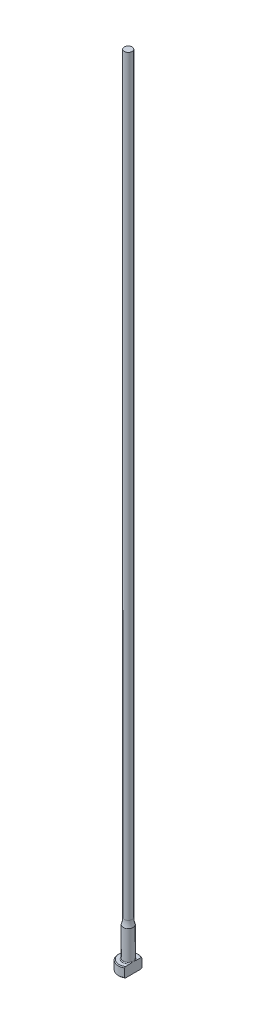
ISO-10303-21;
HEADER;
FILE_DESCRIPTION(('STEP AP214'),'2;1');
FILE_NAME('part.step','',(''),(''),'','','');
FILE_SCHEMA(('AUTOMOTIVE_DESIGN { 1 0 10303 214 1 1 1 1 }'));
ENDSEC;
DATA;
#1=APPLICATION_CONTEXT('core data for automotive mechanical design processes');
#2=APPLICATION_PROTOCOL_DEFINITION('international standard','automotive_design',2000,#1);
#3=PRODUCT_CONTEXT('',#1,'mechanical');
#4=PRODUCT('Part','Part','',(#3));
#5=PRODUCT_RELATED_PRODUCT_CATEGORY('part','',(#4));
#6=PRODUCT_DEFINITION_FORMATION('','',#4);
#7=PRODUCT_DEFINITION_CONTEXT('part definition',#1,'design');
#8=PRODUCT_DEFINITION('design','',#6,#7);
#9=PRODUCT_DEFINITION_SHAPE('','',#8);
#10=(LENGTH_UNIT() NAMED_UNIT(*) SI_UNIT(.MILLI.,.METRE.));
#11=(NAMED_UNIT(*) PLANE_ANGLE_UNIT() SI_UNIT($,.RADIAN.));
#12=(NAMED_UNIT(*) SI_UNIT($,.STERADIAN.) SOLID_ANGLE_UNIT());
#13=UNCERTAINTY_MEASURE_WITH_UNIT(LENGTH_MEASURE(1.E-05),#10,'distance_accuracy_value','');
#14=(GEOMETRIC_REPRESENTATION_CONTEXT(3) GLOBAL_UNCERTAINTY_ASSIGNED_CONTEXT((#13)) GLOBAL_UNIT_ASSIGNED_CONTEXT((#10,
#11,#12)) REPRESENTATION_CONTEXT('',''));
#15=CARTESIAN_POINT('',(0.,0.,0.));
#16=DIRECTION('',(0.,0.,1.));
#17=DIRECTION('',(1.,0.,0.));
#18=AXIS2_PLACEMENT_3D('',#15,#16,#17);
#19=CARTESIAN_POINT('',(-3.17499999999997,3.175,0.));
#20=DIRECTION('',(0.,1.,0.));
#21=DIRECTION('',(0.,0.,1.));
#22=AXIS2_PLACEMENT_3D('',#19,#20,#21);
#23=PLANE('',#22);
#24=CARTESIAN_POINT('',(0.,3.175,0.));
#25=DIRECTION('',(0.,1.,0.));
#26=DIRECTION('',(0.,0.,1.));
#27=AXIS2_PLACEMENT_3D('',#24,#25,#26);
#28=CIRCLE('',#27,2.92099999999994);
#29=CARTESIAN_POINT('',(1.58749999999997,3.175,-2.45195529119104));
#30=VERTEX_POINT('',#29);
#31=CARTESIAN_POINT('',(1.58749999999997,3.175,2.45195529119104));
#32=VERTEX_POINT('',#31);
#33=EDGE_CURVE('E105',#30,#32,#28,.T.);
#34=ORIENTED_EDGE('',*,*,#33,.T.);
#35=DIRECTION('',(0.,0.,1.));
#36=VECTOR('',#35,1.);
#37=CARTESIAN_POINT('',(1.58749999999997,3.17499999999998,2.74963065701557));
#38=LINE('',#37,#36);
#39=CARTESIAN_POINT('',(1.58749999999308,3.175,0.933255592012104));
#40=VERTEX_POINT('',#39);
#41=EDGE_CURVE('E126',#40,#32,#38,.T.);
#42=ORIENTED_EDGE('',*,*,#41,.F.);
#43=CARTESIAN_POINT('',(0.,3.175,0.));
#44=DIRECTION('',(0.,1.,0.));
#45=DIRECTION('',(0.,0.,1.));
#46=AXIS2_PLACEMENT_3D('',#43,#44,#45);
#47=CIRCLE('',#46,1.84149999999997);
#48=CARTESIAN_POINT('',(1.58749999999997,3.17500000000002,-0.933255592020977));
#49=VERTEX_POINT('',#48);
#50=EDGE_CURVE('E11',#40,#49,#47,.F.);
#51=ORIENTED_EDGE('',*,*,#50,.T.);
#52=EDGE_CURVE('E52',#30,#49,#38,.T.);
#53=ORIENTED_EDGE('',*,*,#52,.F.);
#54=EDGE_LOOP('',(#34,#42,#51,#53));
#55=FACE_BOUND('',#54,.T.);
#56=ADVANCED_FACE('F32',(#55),#23,.T.);
#57=CARTESIAN_POINT('',(0.,259.958771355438,0.));
#58=DIRECTION('',(0.,1.,0.));
#59=DIRECTION('',(0.,0.,1.));
#60=AXIS2_PLACEMENT_3D('',#57,#58,#59);
#61=CYLINDRICAL_SURFACE('',#60,3.17499999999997);
#62=CARTESIAN_POINT('',(0.,2.92100000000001,0.));
#63=DIRECTION('',(0.,1.,0.));
#64=DIRECTION('',(0.,0.,1.));
#65=AXIS2_PLACEMENT_3D('',#62,#63,#64);
#66=CIRCLE('',#65,3.17499999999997);
#67=CARTESIAN_POINT('',(1.58749999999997,2.92100000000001,2.74963065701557));
#68=VERTEX_POINT('',#67);
#69=CARTESIAN_POINT('',(1.58749999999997,2.92100000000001,-2.74963065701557));
#70=VERTEX_POINT('',#69);
#71=EDGE_CURVE('E98',#68,#70,#66,.F.);
#72=ORIENTED_EDGE('',*,*,#71,.T.);
#73=DIRECTION('',(0.,-1.,0.));
#74=VECTOR('',#73,1.);
#75=CARTESIAN_POINT('',(1.58749999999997,254.001,-2.74963065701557));
#76=LINE('',#75,#74);
#77=CARTESIAN_POINT('',(1.58749999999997,0.253999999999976,-2.74963065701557));
#78=VERTEX_POINT('',#77);
#79=EDGE_CURVE('E141',#70,#78,#76,.T.);
#80=ORIENTED_EDGE('',*,*,#79,.T.);
#81=CARTESIAN_POINT('',(0.,0.253999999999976,0.));
#82=DIRECTION('',(0.,-1.,0.));
#83=DIRECTION('',(0.,0.,-1.));
#84=AXIS2_PLACEMENT_3D('',#81,#82,#83);
#85=CIRCLE('',#84,3.17499999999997);
#86=CARTESIAN_POINT('',(1.58749999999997,0.253999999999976,2.74963065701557));
#87=VERTEX_POINT('',#86);
#88=EDGE_CURVE('E95',#78,#87,#85,.F.);
#89=ORIENTED_EDGE('',*,*,#88,.T.);
#90=DIRECTION('',(0.,-1.,0.));
#91=VECTOR('',#90,1.);
#92=CARTESIAN_POINT('',(1.58749999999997,254.001,2.74963065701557));
#93=LINE('',#92,#91);
#94=EDGE_CURVE('E88',#68,#87,#93,.T.);
#95=ORIENTED_EDGE('',*,*,#94,.F.);
#96=EDGE_LOOP('',(#72,#80,#89,#95));
#97=FACE_BOUND('',#96,.T.);
#98=ADVANCED_FACE('F191',(#97),#61,.T.);
#99=CARTESIAN_POINT('',(0.,0.,0.));
#100=DIRECTION('',(0.,-1.,0.));
#101=DIRECTION('',(0.,0.,-1.));
#102=AXIS2_PLACEMENT_3D('',#99,#100,#101);
#103=PLANE('',#102);
#104=CARTESIAN_POINT('',(0.,0.,0.));
#105=DIRECTION('',(0.,-1.,0.));
#106=DIRECTION('',(0.,0.,-1.));
#107=AXIS2_PLACEMENT_3D('',#104,#105,#106);
#108=CIRCLE('',#107,2.92100000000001);
#109=CARTESIAN_POINT('',(1.58749999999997,0.,2.45195529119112));
#110=VERTEX_POINT('',#109);
#111=CARTESIAN_POINT('',(1.58749999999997,0.,-2.45195529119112));
#112=VERTEX_POINT('',#111);
#113=EDGE_CURVE('E93',#110,#112,#108,.T.);
#114=ORIENTED_EDGE('',*,*,#113,.T.);
#115=DIRECTION('',(0.,0.,1.));
#116=VECTOR('',#115,1.);
#117=CARTESIAN_POINT('',(1.58749999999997,0.,2.74963065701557));
#118=LINE('',#117,#116);
#119=EDGE_CURVE('E78',#112,#110,#118,.T.);
#120=ORIENTED_EDGE('',*,*,#119,.T.);
#121=EDGE_LOOP('',(#114,#120));
#122=FACE_BOUND('',#121,.T.);
#123=ADVANCED_FACE('F97',(#122),#103,.T.);
#124=CARTESIAN_POINT('',(0.,3.17499999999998,0.));
#125=DIRECTION('',(0.,-1.,0.));
#126=DIRECTION('',(0.,0.,-1.));
#127=AXIS2_PLACEMENT_3D('',#124,#125,#126);
#128=CONICAL_SURFACE('',#127,2.92099999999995,0.785398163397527);
#129=ORIENTED_EDGE('',*,*,#71,.F.);
#130=CARTESIAN_POINT('',(1.58749999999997,-0.16162066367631,-6.0529050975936));
#131=CARTESIAN_POINT('',(1.58749999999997,-0.0288893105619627,-5.91567682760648));
#132=CARTESIAN_POINT('',(1.58749999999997,0.103699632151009,-5.7783103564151));
#133=CARTESIAN_POINT('',(1.58749999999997,0.368508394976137,-5.50321874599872));
#134=CARTESIAN_POINT('',(1.58749999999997,0.500728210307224,-5.36549360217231));
#135=CARTESIAN_POINT('',(1.58749999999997,0.764778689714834,-5.08953516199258));
#136=CARTESIAN_POINT('',(1.58749999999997,0.896609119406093,-4.9513016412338));
#137=CARTESIAN_POINT('',(1.58749999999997,1.15968706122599,-4.67428233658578));
#138=CARTESIAN_POINT('',(1.58749999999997,1.29093457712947,-4.53549655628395));
#139=CARTESIAN_POINT('',(1.58749999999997,1.55007705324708,-4.25997724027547));
#140=CARTESIAN_POINT('',(1.58749999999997,1.67798684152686,-4.12325766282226));
#141=CARTESIAN_POINT('',(1.58749999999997,1.9328486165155,-3.84892898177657));
#142=CARTESIAN_POINT('',(1.58749999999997,2.05980060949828,-3.71131988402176));
#143=CARTESIAN_POINT('',(1.58749999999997,2.31237508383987,-3.43493978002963));
#144=CARTESIAN_POINT('',(1.58749999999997,2.43799784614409,-3.29616903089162));
#145=CARTESIAN_POINT('',(1.58749999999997,2.68741369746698,-3.01699558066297));
#146=CARTESIAN_POINT('',(1.58749999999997,2.81120686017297,-2.8765929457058));
#147=CARTESIAN_POINT('',(1.58749999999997,3.00875865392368,-2.64816703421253));
#148=CARTESIAN_POINT('',(1.58749999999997,3.08336151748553,-2.56087478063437));
#149=CARTESIAN_POINT('',(1.58749999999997,3.2312387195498,-2.38515423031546));
#150=CARTESIAN_POINT('',(1.58749999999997,3.30451292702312,-2.29672582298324));
#151=CARTESIAN_POINT('',(1.58749999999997,3.45004422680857,-2.1174740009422));
#152=CARTESIAN_POINT('',(1.58749999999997,3.5222823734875,-2.02663514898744));
#153=CARTESIAN_POINT('',(1.58749999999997,3.66423097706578,-1.8430252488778));
#154=CARTESIAN_POINT('',(1.58749999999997,3.73394203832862,-1.75025467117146));
#155=CARTESIAN_POINT('',(1.58749999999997,3.87080633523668,-1.5606747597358));
#156=CARTESIAN_POINT('',(1.58749999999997,3.93790459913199,-1.46382547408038));
#157=CARTESIAN_POINT('',(1.58749999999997,4.06669147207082,-1.26632594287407));
#158=CARTESIAN_POINT('',(1.58749999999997,4.1283726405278,-1.16567073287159));
#159=CARTESIAN_POINT('',(1.58749999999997,4.21402252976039,-1.01165766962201));
#160=CARTESIAN_POINT('',(1.58749999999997,4.24127929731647,-0.960142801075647));
#161=CARTESIAN_POINT('',(1.58749999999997,4.2930979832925,-0.855780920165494));
#162=CARTESIAN_POINT('',(1.58749999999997,4.31765941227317,-0.802933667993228));
#163=CARTESIAN_POINT('',(1.58749999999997,4.38614656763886,-0.642461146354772));
#164=CARTESIAN_POINT('',(1.58749999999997,4.42510149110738,-0.532518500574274));
#165=CARTESIAN_POINT('',(1.58749999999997,4.46726244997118,-0.367680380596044));
#166=CARTESIAN_POINT('',(1.58749999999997,4.47844427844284,-0.314802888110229));
#167=CARTESIAN_POINT('',(1.58749999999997,4.49576654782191,-0.208209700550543));
#168=CARTESIAN_POINT('',(1.58749999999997,4.50190743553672,-0.154494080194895));
#169=CARTESIAN_POINT('',(1.58749999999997,4.50871296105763,-0.0468792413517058));
#170=CARTESIAN_POINT('',(1.58749999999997,4.5093945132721,0.00701889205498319));
#171=CARTESIAN_POINT('',(1.58749999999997,4.50527679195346,0.114606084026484));
#172=CARTESIAN_POINT('',(1.58749999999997,4.50047706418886,0.168295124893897));
#173=CARTESIAN_POINT('',(1.58749999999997,4.48579689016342,0.27448544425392));
#174=CARTESIAN_POINT('',(1.58749999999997,4.47596081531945,0.32699298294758));
#175=CARTESIAN_POINT('',(1.58749999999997,4.45181809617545,0.430974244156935));
#176=CARTESIAN_POINT('',(1.58749999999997,4.4375096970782,0.482447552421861));
#177=CARTESIAN_POINT('',(1.58749999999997,4.40502489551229,0.584460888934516));
#178=CARTESIAN_POINT('',(1.58749999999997,4.386827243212,0.634994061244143));
#179=CARTESIAN_POINT('',(1.58749999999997,4.34729308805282,0.734789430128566));
#180=CARTESIAN_POINT('',(1.58749999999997,4.3259572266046,0.784051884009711));
#181=CARTESIAN_POINT('',(1.58749999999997,4.25791922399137,0.930549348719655));
#182=CARTESIAN_POINT('',(1.58749999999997,4.20736047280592,1.0259880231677));
#183=CARTESIAN_POINT('',(1.58749999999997,4.0995545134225,1.21304313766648));
#184=CARTESIAN_POINT('',(1.58749999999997,4.04229912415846,1.30465471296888));
#185=CARTESIAN_POINT('',(1.58749999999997,3.92308746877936,1.48526211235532));
#186=CARTESIAN_POINT('',(1.58749999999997,3.86111349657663,1.57424615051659));
#187=CARTESIAN_POINT('',(1.58749999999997,3.73408621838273,1.74990003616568));
#188=CARTESIAN_POINT('',(1.58749999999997,3.66903444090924,1.83657099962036));
#189=CARTESIAN_POINT('',(1.58749999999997,3.53583371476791,2.00931764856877));
#190=CARTESIAN_POINT('',(1.58749999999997,3.46765527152,2.09537048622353));
#191=CARTESIAN_POINT('',(1.58749999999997,3.32960643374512,2.26611736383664));
#192=CARTESIAN_POINT('',(1.58749999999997,3.25973586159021,2.35081125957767));
#193=CARTESIAN_POINT('',(1.58749999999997,3.04858139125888,2.60290121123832));
#194=CARTESIAN_POINT('',(1.58749999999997,2.90542388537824,2.76872537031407));
#195=CARTESIAN_POINT('',(1.58749999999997,2.64069522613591,3.06970913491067));
#196=CARTESIAN_POINT('',(1.58749999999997,2.51959458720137,3.20528660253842));
#197=CARTESIAN_POINT('',(1.58749999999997,2.27590400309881,3.47510321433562));
#198=CARTESIAN_POINT('',(1.58749999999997,2.15331401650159,3.60934232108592));
#199=CARTESIAN_POINT('',(1.58749999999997,1.90694239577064,3.87695374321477));
#200=CARTESIAN_POINT('',(1.58749999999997,1.78315974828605,4.0103251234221));
#201=CARTESIAN_POINT('',(1.58749999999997,1.53478104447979,4.27630880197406));
#202=CARTESIAN_POINT('',(1.58749999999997,1.41018498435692,4.40892109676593));
#203=CARTESIAN_POINT('',(1.58749999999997,1.0457468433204,4.79499418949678));
#204=CARTESIAN_POINT('',(1.58749999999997,0.80507680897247,5.04767313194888));
#205=CARTESIAN_POINT('',(1.58749999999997,0.443121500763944,5.42550911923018));
#206=CARTESIAN_POINT('',(1.58749999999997,0.322378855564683,5.55118772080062));
#207=CARTESIAN_POINT('',(1.58749999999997,0.0805914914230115,5.80225207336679));
#208=CARTESIAN_POINT('',(1.58749999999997,-0.040453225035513,5.92763782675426));
#209=CARTESIAN_POINT('',(1.58749999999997,-0.161620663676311,6.0529050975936));
#210=B_SPLINE_CURVE_WITH_KNOTS('',3,(#130,#131,#132,#133,#134,#135,#136,#137,#138,#139,#140,
#141,#142,#143,#144,#145,#146,#147,#148,#149,#150,#151,#152,#153,#154,#155,#156,#157,#158,#159,
#160,#161,#162,#163,#164,#165,#166,#167,#168,#169,#170,#171,#172,#173,#174,#175,#176,#177,#178,
#179,#180,#181,#182,#183,#184,#185,#186,#187,#188,#189,#190,#191,#192,#193,#194,#195,#196,#197,
#198,#199,#200,#201,#202,#203,#204,#205,#206,#207,#208,#209),.UNSPECIFIED.,.F.,.F.,(4,2,2,2,2,2,
2,2,2,2,2,2,2,2,2,2,2,2,2,2,2,2,2,2,2,2,2,2,2,2,2,2,2,2,2,2,2,2,2,4),(0.,0.572750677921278,
1.14550874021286,1.71856057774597,2.29160869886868,2.85328006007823,3.4149477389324,
3.97649423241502,4.53801804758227,4.88249307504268,5.22700189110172,5.5751532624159,
5.92322081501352,6.27657800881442,6.63041319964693,6.80518126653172,6.9799810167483,
7.3282426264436,7.49018491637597,7.65211285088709,7.81353889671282,7.97497832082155,
8.13501929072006,8.29512313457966,8.45612518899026,8.61709438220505,8.94062993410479,
9.2645649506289,9.58978187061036,9.91483894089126,10.2441741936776,10.5735441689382,
11.2306812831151,11.7760337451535,12.3214014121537,12.8672825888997,13.4131663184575,
14.4600164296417,14.9828595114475,15.5056983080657),.UNSPECIFIED.);
#211=EDGE_CURVE('E118',#32,#68,#210,.T.);
#212=ORIENTED_EDGE('',*,*,#211,.F.);
#213=ORIENTED_EDGE('',*,*,#33,.F.);
#214=EDGE_CURVE('E117',#70,#30,#210,.T.);
#215=ORIENTED_EDGE('',*,*,#214,.F.);
#216=EDGE_LOOP('',(#129,#212,#213,#215));
#217=FACE_BOUND('',#216,.T.);
#218=ADVANCED_FACE('F162',(#217),#128,.T.);
#219=CARTESIAN_POINT('',(0.,0.253999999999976,0.));
#220=DIRECTION('',(0.,1.,0.));
#221=DIRECTION('',(0.,0.,1.));
#222=AXIS2_PLACEMENT_3D('',#219,#220,#221);
#223=CONICAL_SURFACE('',#222,3.17499999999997,0.785398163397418);
#224=ORIENTED_EDGE('',*,*,#88,.F.);
#225=CARTESIAN_POINT('',(1.58749999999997,3.33662066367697,6.0529050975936));
#226=CARTESIAN_POINT('',(1.58749999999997,3.20388931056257,5.91567682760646));
#227=CARTESIAN_POINT('',(1.58749999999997,3.07130036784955,5.77831035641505));
#228=CARTESIAN_POINT('',(1.58749999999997,2.80649160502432,5.50321874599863));
#229=CARTESIAN_POINT('',(1.58749999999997,2.67427178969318,5.3654936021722));
#230=CARTESIAN_POINT('',(1.58749999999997,2.41022131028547,5.08953516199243));
#231=CARTESIAN_POINT('',(1.58749999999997,2.27839088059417,4.95130164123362));
#232=CARTESIAN_POINT('',(1.58749999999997,2.01531293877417,4.67428233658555));
#233=CARTESIAN_POINT('',(1.58749999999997,1.88406542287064,4.5354965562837));
#234=CARTESIAN_POINT('',(1.58749999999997,1.62492294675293,4.25997724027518));
#235=CARTESIAN_POINT('',(1.58749999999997,1.49701315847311,4.12325766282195));
#236=CARTESIAN_POINT('',(1.58749999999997,1.24215138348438,3.84892898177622));
#237=CARTESIAN_POINT('',(1.58749999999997,1.11519939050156,3.71131988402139));
#238=CARTESIAN_POINT('',(1.58749999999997,0.862624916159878,3.43493978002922));
#239=CARTESIAN_POINT('',(1.58749999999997,0.737002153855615,3.29616903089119));
#240=CARTESIAN_POINT('',(1.58749999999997,0.487586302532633,3.01699558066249));
#241=CARTESIAN_POINT('',(1.58749999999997,0.363793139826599,2.8765929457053));
#242=CARTESIAN_POINT('',(1.58749999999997,0.166241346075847,2.64816703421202));
#243=CARTESIAN_POINT('',(1.58749999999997,0.0916384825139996,2.56087478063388));
#244=CARTESIAN_POINT('',(1.58749999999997,-0.0562387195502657,2.385154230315));
#245=CARTESIAN_POINT('',(1.58749999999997,-0.129512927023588,2.29672582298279));
#246=CARTESIAN_POINT('',(1.58749999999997,-0.27504422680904,2.11747400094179));
#247=CARTESIAN_POINT('',(1.58749999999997,-0.347282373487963,2.02663514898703));
#248=CARTESIAN_POINT('',(1.58749999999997,-0.489230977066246,1.84302524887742));
#249=CARTESIAN_POINT('',(1.58749999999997,-0.558942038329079,1.7502546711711));
#250=CARTESIAN_POINT('',(1.58749999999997,-0.695806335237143,1.56067475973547));
#251=CARTESIAN_POINT('',(1.58749999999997,-0.762904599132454,1.46382547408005));
#252=CARTESIAN_POINT('',(1.58749999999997,-0.891691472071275,1.26632594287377));
#253=CARTESIAN_POINT('',(1.58749999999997,-0.953372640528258,1.16567073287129));
#254=CARTESIAN_POINT('',(1.58749999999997,-1.03902252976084,1.01165766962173));
#255=CARTESIAN_POINT('',(1.58749999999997,-1.06627929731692,0.960142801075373));
#256=CARTESIAN_POINT('',(1.58749999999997,-1.11809798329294,0.85578092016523));
#257=CARTESIAN_POINT('',(1.58749999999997,-1.14265941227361,0.802933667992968));
#258=CARTESIAN_POINT('',(1.58749999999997,-1.21114656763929,0.642461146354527));
#259=CARTESIAN_POINT('',(1.58749999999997,-1.2501014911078,0.532518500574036));
#260=CARTESIAN_POINT('',(1.58749999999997,-1.29226244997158,0.367680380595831));
#261=CARTESIAN_POINT('',(1.58749999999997,-1.30344427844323,0.314802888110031));
#262=CARTESIAN_POINT('',(1.58749999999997,-1.32076654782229,0.208209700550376));
#263=CARTESIAN_POINT('',(1.58749999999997,-1.3269074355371,0.154494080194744));
#264=CARTESIAN_POINT('',(1.58749999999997,-1.333712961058,0.0468792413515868));
#265=CARTESIAN_POINT('',(1.58749999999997,-1.33439451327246,-0.00701889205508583));
#266=CARTESIAN_POINT('',(1.58749999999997,-1.33027679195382,-0.114606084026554));
#267=CARTESIAN_POINT('',(1.58749999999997,-1.32547706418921,-0.168295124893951));
#268=CARTESIAN_POINT('',(1.58749999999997,-1.31079689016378,-0.274485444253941));
#269=CARTESIAN_POINT('',(1.58749999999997,-1.3009608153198,-0.326992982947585));
#270=CARTESIAN_POINT('',(1.58749999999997,-1.27681809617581,-0.430974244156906));
#271=CARTESIAN_POINT('',(1.58749999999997,-1.26250969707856,-0.482447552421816));
#272=CARTESIAN_POINT('',(1.58749999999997,-1.23002489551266,-0.584460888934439));
#273=CARTESIAN_POINT('',(1.58749999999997,-1.21182724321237,-0.634994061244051));
#274=CARTESIAN_POINT('',(1.58749999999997,-1.1722930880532,-0.734789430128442));
#275=CARTESIAN_POINT('',(1.58749999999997,-1.15095722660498,-0.784051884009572));
#276=CARTESIAN_POINT('',(1.58749999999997,-1.08291922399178,-0.93054934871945));
#277=CARTESIAN_POINT('',(1.58749999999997,-1.03236047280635,-1.02598802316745));
#278=CARTESIAN_POINT('',(1.58749999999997,-0.924554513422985,-1.21304313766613));
#279=CARTESIAN_POINT('',(1.58749999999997,-0.86729912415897,-1.30465471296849));
#280=CARTESIAN_POINT('',(1.58749999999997,-0.748087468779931,-1.48526211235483));
#281=CARTESIAN_POINT('',(1.58749999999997,-0.686113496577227,-1.57424615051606));
#282=CARTESIAN_POINT('',(1.58749999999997,-0.55908621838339,-1.74990003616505));
#283=CARTESIAN_POINT('',(1.58749999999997,-0.494034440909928,-1.83657099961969));
#284=CARTESIAN_POINT('',(1.58749999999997,-0.360833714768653,-2.00931764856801));
#285=CARTESIAN_POINT('',(1.58749999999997,-0.292655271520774,-2.09537048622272));
#286=CARTESIAN_POINT('',(1.58749999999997,-0.154606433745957,-2.26611736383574));
#287=CARTESIAN_POINT('',(1.58749999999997,-0.0847358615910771,-2.35081125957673));
#288=CARTESIAN_POINT('',(1.58749999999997,0.126418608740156,-2.60290121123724));
#289=CARTESIAN_POINT('',(1.58749999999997,0.269576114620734,-2.76872537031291));
#290=CARTESIAN_POINT('',(1.58749999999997,0.534304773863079,-3.06970913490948));
#291=CARTESIAN_POINT('',(1.58749999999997,0.655405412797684,-3.20528660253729));
#292=CARTESIAN_POINT('',(1.58749999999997,0.899095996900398,-3.47510321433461));
#293=CARTESIAN_POINT('',(1.58749999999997,1.02168598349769,-3.60934232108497));
#294=CARTESIAN_POINT('',(1.58749999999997,1.26805760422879,-3.87695374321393));
#295=CARTESIAN_POINT('',(1.58749999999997,1.39184025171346,-4.01032512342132));
#296=CARTESIAN_POINT('',(1.58749999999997,1.64021895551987,-4.2763088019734));
#297=CARTESIAN_POINT('',(1.58749999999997,1.76481501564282,-4.40892109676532));
#298=CARTESIAN_POINT('',(1.58749999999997,2.12925315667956,-4.79499418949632));
#299=CARTESIAN_POINT('',(1.58749999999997,2.36992319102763,-5.04767313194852));
#300=CARTESIAN_POINT('',(1.58749999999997,2.73187849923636,-5.42550911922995));
#301=CARTESIAN_POINT('',(1.58749999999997,2.85262114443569,-5.55118772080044));
#302=CARTESIAN_POINT('',(1.58749999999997,3.09440850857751,-5.8022520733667));
#303=CARTESIAN_POINT('',(1.58749999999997,3.2154532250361,-5.92763782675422));
#304=CARTESIAN_POINT('',(1.58749999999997,3.33662066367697,-6.0529050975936));
#305=B_SPLINE_CURVE_WITH_KNOTS('',3,(#225,#226,#227,#228,#229,#230,#231,#232,#233,#234,#235,
#236,#237,#238,#239,#240,#241,#242,#243,#244,#245,#246,#247,#248,#249,#250,#251,#252,#253,#254,
#255,#256,#257,#258,#259,#260,#261,#262,#263,#264,#265,#266,#267,#268,#269,#270,#271,#272,#273,
#274,#275,#276,#277,#278,#279,#280,#281,#282,#283,#284,#285,#286,#287,#288,#289,#290,#291,#292,
#293,#294,#295,#296,#297,#298,#299,#300,#301,#302,#303,#304),.UNSPECIFIED.,.F.,.F.,(4,2,2,2,2,2,
2,2,2,2,2,2,2,2,2,2,2,2,2,2,2,2,2,2,2,2,2,2,2,2,2,2,2,2,2,2,2,2,2,4),(0.,0.57275067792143,
1.14550874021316,1.71856057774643,2.29160869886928,2.85328006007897,3.41494773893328,
3.97649423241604,4.53801804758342,4.88249307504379,5.2270018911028,5.57515326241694,
5.92322081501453,6.27657800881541,6.63041319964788,6.80518126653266,6.97998101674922,
7.32824262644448,7.49018491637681,7.65211285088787,7.81353889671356,7.97497832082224,
8.1350192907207,8.29512313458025,8.45612518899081,8.61709438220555,8.94062993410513,
9.26456495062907,9.58978187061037,9.91483894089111,10.2441741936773,10.5735441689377,
11.2306812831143,11.776033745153,12.3214014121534,12.8672825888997,13.4131663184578,
14.4600164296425,14.9828595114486,15.505698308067),.UNSPECIFIED.);
#306=EDGE_CURVE('E81',#112,#78,#305,.T.);
#307=ORIENTED_EDGE('',*,*,#306,.F.);
#308=ORIENTED_EDGE('',*,*,#113,.F.);
#309=EDGE_CURVE('E84',#87,#110,#305,.T.);
#310=ORIENTED_EDGE('',*,*,#309,.F.);
#311=EDGE_LOOP('',(#224,#307,#308,#310));
#312=FACE_BOUND('',#311,.T.);
#313=ADVANCED_FACE('F92',(#312),#223,.T.);
#314=CARTESIAN_POINT('',(0.,3.42900000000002,0.));
#315=DIRECTION('',(0.,1.,0.));
#316=DIRECTION('',(0.,0.,1.));
#317=AXIS2_PLACEMENT_3D('',#314,#315,#316);
#318=TOROIDAL_SURFACE('',#317,1.84149999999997,0.254);
#319=CARTESIAN_POINT('',(1.58749999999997,3.42900000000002,0.));
#320=CARTESIAN_POINT('',(1.58749999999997,3.42899942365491,-1.9220514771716E-10));
#321=CARTESIAN_POINT('',(1.58749999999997,3.42899884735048,-1.2261161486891E-07));
#322=CARTESIAN_POINT('',(1.58749999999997,3.42899773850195,-5.09676365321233E-07));
#323=CARTESIAN_POINT('',(1.58749999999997,3.42899720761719,-7.78176328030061E-07));
#324=CARTESIAN_POINT('',(1.58749999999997,3.42899614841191,-1.42307272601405E-06));
#325=CARTESIAN_POINT('',(1.58749999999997,3.42899562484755,-1.80713867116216E-06));
#326=CARTESIAN_POINT('',(1.58749999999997,3.42899463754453,-2.63494846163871E-06));
#327=CARTESIAN_POINT('',(1.58749999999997,3.42899417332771,-3.07814756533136E-06));
#328=CARTESIAN_POINT('',(1.58749999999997,3.42899261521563,-4.66897357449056E-06));
#329=CARTESIAN_POINT('',(1.58749999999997,3.42899159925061,-5.89404908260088E-06));
#330=CARTESIAN_POINT('',(1.58749999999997,3.42898979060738,-8.42427511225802E-06));
#331=CARTESIAN_POINT('',(1.58749999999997,3.42898899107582,-9.7248057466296E-06));
#332=CARTESIAN_POINT('',(1.58749999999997,3.42898598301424,-1.48060601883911E-05));
#333=CARTESIAN_POINT('',(1.58749999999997,3.42898393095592,-1.86838281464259E-05));
#334=CARTESIAN_POINT('',(1.58749999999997,3.42898057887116,-2.63261117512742E-05));
#335=CARTESIAN_POINT('',(1.58749999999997,3.42897922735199,-3.00687417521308E-05));
#336=CARTESIAN_POINT('',(1.58749999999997,3.42897347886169,-4.60276298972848E-05));
#337=CARTESIAN_POINT('',(1.58749999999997,3.42896911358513,-5.8247019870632E-05));
#338=CARTESIAN_POINT('',(1.58749999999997,3.42896211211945,-8.11070097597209E-05));
#339=CARTESIAN_POINT('',(1.58749999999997,3.42895931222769,-9.16953114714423E-05));
#340=CARTESIAN_POINT('',(1.58749999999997,3.42893712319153,-0.000168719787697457));
#341=CARTESIAN_POINT('',(1.58749999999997,3.42890881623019,-0.000232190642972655));
#342=CARTESIAN_POINT('',(1.58749999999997,3.42880276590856,-0.000479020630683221));
#343=CARTESIAN_POINT('',(1.58749999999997,3.42873165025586,-0.00066443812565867));
#344=CARTESIAN_POINT('',(1.58749999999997,3.42845137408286,-0.0013844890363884));
#345=CARTESIAN_POINT('',(1.58749999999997,3.42823526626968,-0.00191701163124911));
#346=CARTESIAN_POINT('',(1.58749999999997,3.42735449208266,-0.00409774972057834));
#347=CARTESIAN_POINT('',(1.58749999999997,3.42669768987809,-0.00574830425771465));
#348=CARTESIAN_POINT('',(1.58749999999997,3.4174405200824,-0.0289985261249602));
#349=CARTESIAN_POINT('',(1.58749999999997,3.40878325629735,-0.0505816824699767));
#350=CARTESIAN_POINT('',(1.58749999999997,3.39189297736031,-0.0929947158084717));
#351=CARTESIAN_POINT('',(1.58749999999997,3.38365605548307,-0.11382315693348));
#352=CARTESIAN_POINT('',(1.58749999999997,3.36635393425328,-0.157956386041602));
#353=CARTESIAN_POINT('',(1.58749999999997,3.35730391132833,-0.181267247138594));
#354=CARTESIAN_POINT('',(1.58749999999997,3.33936775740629,-0.228222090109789));
#355=CARTESIAN_POINT('',(1.58749999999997,3.33048420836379,-0.25186705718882));
#356=CARTESIAN_POINT('',(1.58749999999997,3.30894496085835,-0.310512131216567));
#357=CARTESIAN_POINT('',(1.58749999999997,3.29649449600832,-0.345588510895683));
#358=CARTESIAN_POINT('',(1.58749999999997,3.27296975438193,-0.415278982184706));
#359=CARTESIAN_POINT('',(1.58749999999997,3.26186987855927,-0.449884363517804));
#360=CARTESIAN_POINT('',(1.58749999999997,3.2395832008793,-0.524471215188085));
#361=CARTESIAN_POINT('',(1.58749999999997,3.22860862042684,-0.564517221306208));
#362=CARTESIAN_POINT('',(1.58749999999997,3.20902534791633,-0.645529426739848));
#363=CARTESIAN_POINT('',(1.58749999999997,3.20043582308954,-0.686500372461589));
#364=CARTESIAN_POINT('',(1.58749999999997,3.18611712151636,-0.771546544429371));
#365=CARTESIAN_POINT('',(1.58749999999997,3.18059550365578,-0.815658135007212));
#366=CARTESIAN_POINT('',(1.58749999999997,3.17455396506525,-0.904117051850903));
#367=CARTESIAN_POINT('',(1.58749999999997,3.17401361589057,-0.948462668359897));
#368=CARTESIAN_POINT('',(1.58749999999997,3.17898948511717,-1.02531896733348));
#369=CARTESIAN_POINT('',(1.58749999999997,3.1829739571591,-1.05792141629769));
#370=CARTESIAN_POINT('',(1.58749999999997,3.19569167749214,-1.12184393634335));
#371=CARTESIAN_POINT('',(1.58749999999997,3.20436049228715,-1.1531753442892));
#372=CARTESIAN_POINT('',(1.58749999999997,3.22236152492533,-1.19946468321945));
#373=CARTESIAN_POINT('',(1.58749999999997,3.2295150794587,-1.21526783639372));
#374=CARTESIAN_POINT('',(1.58749999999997,3.24587062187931,-1.24583726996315));
#375=CARTESIAN_POINT('',(1.58749999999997,3.25507530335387,-1.26060215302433));
#376=CARTESIAN_POINT('',(1.58749999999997,3.27378481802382,-1.28575815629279));
#377=CARTESIAN_POINT('',(1.58749999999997,3.28289001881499,-1.29644383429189));
#378=CARTESIAN_POINT('',(1.58749999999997,3.30268460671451,-1.31623154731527));
#379=CARTESIAN_POINT('',(1.58749999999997,3.31337067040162,-1.32533681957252));
#380=CARTESIAN_POINT('',(1.58749999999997,3.33349977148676,-1.33941140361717));
#381=CARTESIAN_POINT('',(1.58749999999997,3.34261446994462,-1.34484814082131));
#382=CARTESIAN_POINT('',(1.58749999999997,3.36161455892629,-1.35416329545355));
#383=CARTESIAN_POINT('',(1.58749999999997,3.37149946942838,-1.35804267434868));
#384=CARTESIAN_POINT('',(1.58749999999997,3.39188678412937,-1.36398436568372));
#385=CARTESIAN_POINT('',(1.58749999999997,3.40239309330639,-1.36603350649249));
#386=CARTESIAN_POINT('',(1.58749999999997,3.42360372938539,-1.3680840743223));
#387=CARTESIAN_POINT('',(1.58749999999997,3.43430795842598,-1.36808648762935));
#388=CARTESIAN_POINT('',(1.58749999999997,3.45433283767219,-1.36616208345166));
#389=CARTESIAN_POINT('',(1.58749999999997,3.46367506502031,-1.36444960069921));
#390=CARTESIAN_POINT('',(1.58749999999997,3.48195519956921,-1.35953338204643));
#391=CARTESIAN_POINT('',(1.58749999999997,3.49089304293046,-1.3563294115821));
#392=CARTESIAN_POINT('',(1.58749999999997,3.50850302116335,-1.34848006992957));
#393=CARTESIAN_POINT('',(1.58749999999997,3.5171531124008,-1.34378578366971));
#394=CARTESIAN_POINT('',(1.58749999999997,3.53371257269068,-1.33324445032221));
#395=CARTESIAN_POINT('',(1.58749999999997,3.54162163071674,-1.32739692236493));
#396=CARTESIAN_POINT('',(1.58749999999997,3.56107121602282,-1.31107304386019));
#397=CARTESIAN_POINT('',(1.58749999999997,3.57202221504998,-1.29989286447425));
#398=CARTESIAN_POINT('',(1.58749999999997,3.59202509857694,-1.27593566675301));
#399=CARTESIAN_POINT('',(1.58749999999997,3.60107086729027,-1.26315370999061));
#400=CARTESIAN_POINT('',(1.58749999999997,3.62186023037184,-1.22930733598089));
#401=CARTESIAN_POINT('',(1.58749999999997,3.63240584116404,-1.20751096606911));
#402=CARTESIAN_POINT('',(1.58749999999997,3.65004643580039,-1.16266144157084));
#403=CARTESIAN_POINT('',(1.58749999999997,3.65714435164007,-1.13960937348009));
#404=CARTESIAN_POINT('',(1.58749999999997,3.67265428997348,-1.07603916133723));
#405=CARTESIAN_POINT('',(1.58749999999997,3.67834921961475,-1.03486686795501));
#406=CARTESIAN_POINT('',(1.58749999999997,3.68382880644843,-0.951558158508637));
#407=CARTESIAN_POINT('',(1.58749999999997,3.68350976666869,-0.909417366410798));
#408=CARTESIAN_POINT('',(1.58749999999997,3.67745397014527,-0.811383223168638));
#409=CARTESIAN_POINT('',(1.58749999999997,3.66993873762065,-0.755610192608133));
#410=CARTESIAN_POINT('',(1.58749999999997,3.64933373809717,-0.644937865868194));
#411=CARTESIAN_POINT('',(1.58749999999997,3.63621897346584,-0.59004364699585));
#412=CARTESIAN_POINT('',(1.58749999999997,3.60740922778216,-0.485757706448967));
#413=CARTESIAN_POINT('',(1.58749999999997,3.59201096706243,-0.436281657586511));
#414=CARTESIAN_POINT('',(1.58749999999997,3.55922497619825,-0.338551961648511));
#415=CARTESIAN_POINT('',(1.58749999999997,3.5418584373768,-0.290291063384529));
#416=CARTESIAN_POINT('',(1.58749999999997,3.51760237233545,-0.225557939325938));
#417=CARTESIAN_POINT('',(1.58749999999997,3.51126413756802,-0.208874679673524));
#418=CARTESIAN_POINT('',(1.58749999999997,3.49830042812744,-0.17512392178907));
#419=CARTESIAN_POINT('',(1.58749999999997,3.49167176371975,-0.158057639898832));
#420=CARTESIAN_POINT('',(1.58749999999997,3.47585523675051,-0.117638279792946));
#421=CARTESIAN_POINT('',(1.58749999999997,3.46662970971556,-0.0943002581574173));
#422=CARTESIAN_POINT('',(1.58749999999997,3.44889695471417,-0.0497824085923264));
#423=CARTESIAN_POINT('',(1.58749999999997,3.44040039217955,-0.028598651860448));
#424=CARTESIAN_POINT('',(1.58749999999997,3.43130364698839,-0.00575168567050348));
#425=CARTESIAN_POINT('',(1.58749999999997,3.43064818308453,-0.00410451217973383));
#426=CARTESIAN_POINT('',(1.58749999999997,3.42976776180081,-0.00192459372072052));
#427=CARTESIAN_POINT('',(1.58749999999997,3.42955062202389,-0.00138952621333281));
#428=CARTESIAN_POINT('',(1.58749999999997,3.42926908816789,-0.000666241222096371));
#429=CARTESIAN_POINT('',(1.58749999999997,3.42919771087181,-0.000480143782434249));
#430=CARTESIAN_POINT('',(1.58749999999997,3.42909131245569,-0.000232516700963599));
#431=CARTESIAN_POINT('',(1.58749999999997,3.42906294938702,-0.000168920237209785));
#432=CARTESIAN_POINT('',(1.58749999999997,3.42904072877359,-9.17527162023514E-05));
#433=CARTESIAN_POINT('',(1.58749999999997,3.42903792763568,-8.11550293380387E-05));
#434=CARTESIAN_POINT('',(1.58749999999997,3.42903091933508,-5.82743948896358E-05));
#435=CARTESIAN_POINT('',(1.58749999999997,3.42902654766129,-4.60440001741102E-05));
#436=CARTESIAN_POINT('',(1.58749999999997,3.42902079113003,-3.00727682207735E-05));
#437=CARTESIAN_POINT('',(1.58749999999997,3.42901943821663,-2.63286807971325E-05));
#438=CARTESIAN_POINT('',(1.58749999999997,3.42901608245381,-1.86836529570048E-05));
#439=CARTESIAN_POINT('',(1.58749999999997,3.4290140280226,-1.48046517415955E-05));
#440=CARTESIAN_POINT('',(1.58749999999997,3.42901101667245,-9.72223943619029E-06));
#441=CARTESIAN_POINT('',(1.58749999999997,3.42901021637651,-8.42159649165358E-06));
#442=CARTESIAN_POINT('',(1.58749999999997,3.42900840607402,-5.89129729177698E-06));
#443=CARTESIAN_POINT('',(1.58749999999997,3.42900738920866,-4.66626867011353E-06));
#444=CARTESIAN_POINT('',(1.58749999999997,3.42900582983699,-3.07568803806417E-06));
#445=CARTESIAN_POINT('',(1.58749999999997,3.42900536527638,-2.63259565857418E-06));
#446=CARTESIAN_POINT('',(1.58749999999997,3.4290043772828,-1.80506085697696E-06));
#447=CARTESIAN_POINT('',(1.58749999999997,3.42900385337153,-1.42116387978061E-06));
#448=CARTESIAN_POINT('',(1.58749999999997,3.42900279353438,-7.76675643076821E-07));
#449=CARTESIAN_POINT('',(1.58749999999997,3.42900226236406,-5.08406487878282E-07));
#450=CARTESIAN_POINT('',(1.58749999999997,3.42900115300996,-1.21901887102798E-07));
#451=CARTESIAN_POINT('',(1.58749999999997,3.42900057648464,1.92251677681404E-10));
#452=CARTESIAN_POINT('',(1.58749999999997,3.42900000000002,0.));
#453=B_SPLINE_CURVE_WITH_KNOTS('',3,(#319,#320,#321,#322,#323,#324,#325,#326,#327,#328,#329,
#330,#331,#332,#333,#334,#335,#336,#337,#338,#339,#340,#341,#342,#343,#344,#345,#346,#347,#348,
#349,#350,#351,#352,#353,#354,#355,#356,#357,#358,#359,#360,#361,#362,#363,#364,#365,#366,#367,
#368,#369,#370,#371,#372,#373,#374,#375,#376,#377,#378,#379,#380,#381,#382,#383,#384,#385,#386,
#387,#388,#389,#390,#391,#392,#393,#394,#395,#396,#397,#398,#399,#400,#401,#402,#403,#404,#405,
#406,#407,#408,#409,#410,#411,#412,#413,#414,#415,#416,#417,#418,#419,#420,#421,#422,#423,#424,
#425,#426,#427,#428,#429,#430,#431,#432,#433,#434,#435,#436,#437,#438,#439,#440,#441,#442,#443,
#444,#445,#446,#447,#448,#449,#450,#451,#452),.UNSPECIFIED.,.T.,.F.,(4,2,2,2,2,2,2,2,2,2,2,2,2,
2,2,2,2,2,2,2,2,2,2,2,2,2,2,2,2,2,2,2,2,2,2,2,2,2,2,2,2,2,2,2,2,2,2,2,2,2,2,2,2,2,2,2,2,2,2,2,2,
2,2,2,2,2,4),(0.,1.72815458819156E-06,3.50429255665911E-06,5.44431004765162E-06,
7.3675525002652E-06,1.2119089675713E-05,1.66953775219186E-05,2.98160400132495E-05,
4.17409564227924E-05,8.0660475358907E-05,0.000113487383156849,0.000321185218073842,
0.000917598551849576,0.00264089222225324,0.00797105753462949,0.0777276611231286,
0.144923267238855,0.219939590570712,0.295714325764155,0.407362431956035,0.516367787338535,
0.640878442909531,0.766362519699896,0.899536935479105,1.03216495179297,1.13045740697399,
1.22743103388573,1.27935899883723,1.33135556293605,1.37333248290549,1.41522237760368,
1.44693946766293,1.47863694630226,1.51056074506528,1.54246916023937,1.57083210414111,
1.59919951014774,1.62861579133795,1.65804436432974,1.70472658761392,1.75155645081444,
1.82378709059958,1.89595619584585,2.01995471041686,2.1460932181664,2.31447224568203,
2.48361094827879,2.6389891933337,2.79283011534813,2.84637031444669,2.9012946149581,
2.97658236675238,3.04504771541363,3.05036697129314,3.05209849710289,3.05269709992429,
3.05290520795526,3.05293806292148,3.05297701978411,3.05298895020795,3.05300207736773,
3.05300665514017,3.0530114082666,3.05301333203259,3.05301527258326,3.05301704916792,
3.05301877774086),.UNSPECIFIED.);
#454=CARTESIAN_POINT('',(1.58749999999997,3.42900000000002,0.));
#455=VERTEX_POINT('',#454);
#456=EDGE_CURVE('E47',#455,#49,#453,.T.);
#457=ORIENTED_EDGE('',*,*,#456,.T.);
#458=ORIENTED_EDGE('',*,*,#50,.F.);
#459=CARTESIAN_POINT('',(1.58749999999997,3.42900000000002,0.));
#460=CARTESIAN_POINT('',(1.58749999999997,3.42900057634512,1.9220512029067E-10));
#461=CARTESIAN_POINT('',(1.58749999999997,3.42900115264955,1.22611614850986E-07));
#462=CARTESIAN_POINT('',(1.58749999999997,3.42900226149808,5.09676365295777E-07));
#463=CARTESIAN_POINT('',(1.58749999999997,3.42900279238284,7.78176328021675E-07));
#464=CARTESIAN_POINT('',(1.58749999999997,3.42900385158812,1.42307272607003E-06));
#465=CARTESIAN_POINT('',(1.58749999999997,3.42900437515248,1.80713867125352E-06));
#466=CARTESIAN_POINT('',(1.58749999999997,3.4290053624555,2.63494846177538E-06));
#467=CARTESIAN_POINT('',(1.58749999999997,3.42900582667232,3.0781475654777E-06));
#468=CARTESIAN_POINT('',(1.58749999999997,3.4290073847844,4.66897357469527E-06));
#469=CARTESIAN_POINT('',(1.58749999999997,3.42900840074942,5.89404908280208E-06));
#470=CARTESIAN_POINT('',(1.58749999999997,3.42901020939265,8.42427511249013E-06));
#471=CARTESIAN_POINT('',(1.58749999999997,3.42901100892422,9.72480574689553E-06));
#472=CARTESIAN_POINT('',(1.58749999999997,3.42901401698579,1.48060601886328E-05));
#473=CARTESIAN_POINT('',(1.58749999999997,3.42901606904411,1.86838281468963E-05));
#474=CARTESIAN_POINT('',(1.58749999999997,3.42901942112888,2.63261117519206E-05));
#475=CARTESIAN_POINT('',(1.58749999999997,3.42902077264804,3.00687417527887E-05));
#476=CARTESIAN_POINT('',(1.58749999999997,3.42902652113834,4.60276298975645E-05));
#477=CARTESIAN_POINT('',(1.58749999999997,3.4290308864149,5.82470198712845E-05));
#478=CARTESIAN_POINT('',(1.58749999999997,3.42903788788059,8.11070097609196E-05));
#479=CARTESIAN_POINT('',(1.58749999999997,3.42904068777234,9.16953114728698E-05));
#480=CARTESIAN_POINT('',(1.58749999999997,3.4290628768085,0.000168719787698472));
#481=CARTESIAN_POINT('',(1.58749999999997,3.42909118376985,0.000232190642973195));
#482=CARTESIAN_POINT('',(1.58749999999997,3.42919723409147,0.000479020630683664));
#483=CARTESIAN_POINT('',(1.58749999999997,3.42926834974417,0.000664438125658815));
#484=CARTESIAN_POINT('',(1.58749999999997,3.42954862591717,0.00138448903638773));
#485=CARTESIAN_POINT('',(1.58749999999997,3.42976473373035,0.00191701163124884));
#486=CARTESIAN_POINT('',(1.58749999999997,3.43064550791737,0.00409774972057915));
#487=CARTESIAN_POINT('',(1.58749999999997,3.43130231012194,0.00574830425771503));
#488=CARTESIAN_POINT('',(1.58749999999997,3.44055947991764,0.0289985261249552));
#489=CARTESIAN_POINT('',(1.58749999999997,3.44921674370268,0.0505816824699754));
#490=CARTESIAN_POINT('',(1.58749999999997,3.46610702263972,0.0929947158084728));
#491=CARTESIAN_POINT('',(1.58749999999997,3.47434394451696,0.11382315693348));
#492=CARTESIAN_POINT('',(1.58749999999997,3.49164606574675,0.157956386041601));
#493=CARTESIAN_POINT('',(1.58749999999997,3.5006960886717,0.181267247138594));
#494=CARTESIAN_POINT('',(1.58749999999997,3.51863224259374,0.228222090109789));
#495=CARTESIAN_POINT('',(1.58749999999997,3.52751579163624,0.25186705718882));
#496=CARTESIAN_POINT('',(1.58749999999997,3.54905503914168,0.310512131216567));
#497=CARTESIAN_POINT('',(1.58749999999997,3.56150550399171,0.345588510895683));
#498=CARTESIAN_POINT('',(1.58749999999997,3.5850302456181,0.415278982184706));
#499=CARTESIAN_POINT('',(1.58749999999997,3.59613012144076,0.449884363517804));
#500=CARTESIAN_POINT('',(1.58749999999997,3.61841679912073,0.524471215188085));
#501=CARTESIAN_POINT('',(1.58749999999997,3.62939137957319,0.564517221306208));
#502=CARTESIAN_POINT('',(1.58749999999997,3.6489746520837,0.645529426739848));
#503=CARTESIAN_POINT('',(1.58749999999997,3.65756417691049,0.686500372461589));
#504=CARTESIAN_POINT('',(1.58749999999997,3.67188287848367,0.771546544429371));
#505=CARTESIAN_POINT('',(1.58749999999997,3.67740449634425,0.815658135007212));
#506=CARTESIAN_POINT('',(1.58749999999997,3.68344603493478,0.904117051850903));
#507=CARTESIAN_POINT('',(1.58749999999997,3.68398638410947,0.948462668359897));
#508=CARTESIAN_POINT('',(1.58749999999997,3.67901051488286,1.02531896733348));
#509=CARTESIAN_POINT('',(1.58749999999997,3.67502604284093,1.05792141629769));
#510=CARTESIAN_POINT('',(1.58749999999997,3.66230832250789,1.12184393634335));
#511=CARTESIAN_POINT('',(1.58749999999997,3.65363950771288,1.1531753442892));
#512=CARTESIAN_POINT('',(1.58749999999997,3.6356384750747,1.19946468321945));
#513=CARTESIAN_POINT('',(1.58749999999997,3.62848492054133,1.21526783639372));
#514=CARTESIAN_POINT('',(1.58749999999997,3.61212937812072,1.24583726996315));
#515=CARTESIAN_POINT('',(1.58749999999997,3.60292469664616,1.26060215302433));
#516=CARTESIAN_POINT('',(1.58749999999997,3.58421518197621,1.28575815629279));
#517=CARTESIAN_POINT('',(1.58749999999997,3.57510998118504,1.29644383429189));
#518=CARTESIAN_POINT('',(1.58749999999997,3.55531539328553,1.31623154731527));
#519=CARTESIAN_POINT('',(1.58749999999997,3.54462932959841,1.32533681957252));
#520=CARTESIAN_POINT('',(1.58749999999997,3.52450022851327,1.33941140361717));
#521=CARTESIAN_POINT('',(1.58749999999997,3.51538553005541,1.34484814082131));
#522=CARTESIAN_POINT('',(1.58749999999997,3.49638544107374,1.35416329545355));
#523=CARTESIAN_POINT('',(1.58749999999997,3.48650053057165,1.35804267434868));
#524=CARTESIAN_POINT('',(1.58749999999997,3.46611321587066,1.36398436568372));
#525=CARTESIAN_POINT('',(1.58749999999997,3.45560690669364,1.36603350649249));
#526=CARTESIAN_POINT('',(1.58749999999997,3.43439627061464,1.3680840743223));
#527=CARTESIAN_POINT('',(1.58749999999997,3.42369204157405,1.36808648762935));
#528=CARTESIAN_POINT('',(1.58749999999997,3.40366716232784,1.36616208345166));
#529=CARTESIAN_POINT('',(1.58749999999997,3.39432493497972,1.36444960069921));
#530=CARTESIAN_POINT('',(1.58749999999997,3.37604480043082,1.35953338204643));
#531=CARTESIAN_POINT('',(1.58749999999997,3.36710695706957,1.3563294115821));
#532=CARTESIAN_POINT('',(1.58749999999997,3.34949697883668,1.34848006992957));
#533=CARTESIAN_POINT('',(1.58749999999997,3.34084688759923,1.34378578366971));
#534=CARTESIAN_POINT('',(1.58749999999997,3.32428742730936,1.33324445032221));
#535=CARTESIAN_POINT('',(1.58749999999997,3.31637836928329,1.32739692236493));
#536=CARTESIAN_POINT('',(1.58749999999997,3.29692878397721,1.31107304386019));
#537=CARTESIAN_POINT('',(1.58749999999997,3.28597778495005,1.29989286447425));
#538=CARTESIAN_POINT('',(1.58749999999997,3.26597490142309,1.27593566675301));
#539=CARTESIAN_POINT('',(1.58749999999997,3.25692913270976,1.26315370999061));
#540=CARTESIAN_POINT('',(1.58749999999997,3.23613976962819,1.22930733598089));
#541=CARTESIAN_POINT('',(1.58749999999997,3.22559415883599,1.20751096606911));
#542=CARTESIAN_POINT('',(1.58749999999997,3.20795356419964,1.16266144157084));
#543=CARTESIAN_POINT('',(1.58749999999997,3.20085564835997,1.13960937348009));
#544=CARTESIAN_POINT('',(1.58749999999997,3.18534571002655,1.07603916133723));
#545=CARTESIAN_POINT('',(1.58749999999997,3.17965078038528,1.03486686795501));
#546=CARTESIAN_POINT('',(1.58749999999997,3.1741711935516,0.951558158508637));
#547=CARTESIAN_POINT('',(1.58749999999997,3.17449023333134,0.909417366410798));
#548=CARTESIAN_POINT('',(1.58749999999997,3.18054602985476,0.811383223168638));
#549=CARTESIAN_POINT('',(1.58749999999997,3.18806126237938,0.755610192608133));
#550=CARTESIAN_POINT('',(1.58749999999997,3.20866626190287,0.644937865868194));
#551=CARTESIAN_POINT('',(1.58749999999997,3.2217810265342,0.59004364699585));
#552=CARTESIAN_POINT('',(1.58749999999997,3.25059077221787,0.485757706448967));
#553=CARTESIAN_POINT('',(1.58749999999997,3.2659890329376,0.43628165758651));
#554=CARTESIAN_POINT('',(1.58749999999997,3.29877502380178,0.338551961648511));
#555=CARTESIAN_POINT('',(1.58749999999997,3.31614156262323,0.290291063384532));
#556=CARTESIAN_POINT('',(1.58749999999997,3.34039762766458,0.225557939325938));
#557=CARTESIAN_POINT('',(1.58749999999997,3.346735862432,0.208874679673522));
#558=CARTESIAN_POINT('',(1.58749999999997,3.35969957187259,0.175123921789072));
#559=CARTESIAN_POINT('',(1.58749999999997,3.3663282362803,0.15805763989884));
#560=CARTESIAN_POINT('',(1.58749999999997,3.3821447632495,0.117638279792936));
#561=CARTESIAN_POINT('',(1.58749999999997,3.39137029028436,0.0943002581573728));
#562=CARTESIAN_POINT('',(1.58749999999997,3.40910304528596,0.0497824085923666));
#563=CARTESIAN_POINT('',(1.58749999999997,3.41759960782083,0.0285986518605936));
#564=CARTESIAN_POINT('',(1.58749999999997,3.42669635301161,0.00575168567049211));
#565=CARTESIAN_POINT('',(1.58749999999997,3.42735181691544,0.00410451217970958));
#566=CARTESIAN_POINT('',(1.58749999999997,3.42823223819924,0.00192459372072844));
#567=CARTESIAN_POINT('',(1.58749999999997,3.42844937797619,0.00138952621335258));
#568=CARTESIAN_POINT('',(1.58749999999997,3.42873091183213,0.000666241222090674));
#569=CARTESIAN_POINT('',(1.58749999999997,3.42880228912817,0.000480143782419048));
#570=CARTESIAN_POINT('',(1.58749999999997,3.42890868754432,0.000232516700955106));
#571=CARTESIAN_POINT('',(1.58749999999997,3.42893705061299,0.000168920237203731));
#572=CARTESIAN_POINT('',(1.58749999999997,3.42895927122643,9.17527161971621E-05));
#573=CARTESIAN_POINT('',(1.58749999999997,3.42896207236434,8.1155029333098E-05));
#574=CARTESIAN_POINT('',(1.58749999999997,3.42896908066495,5.82743948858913E-05));
#575=CARTESIAN_POINT('',(1.58749999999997,3.42897345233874,4.60440001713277E-05));
#576=CARTESIAN_POINT('',(1.58749999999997,3.42897920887,3.00727682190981E-05));
#577=CARTESIAN_POINT('',(1.58749999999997,3.42898056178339,2.63286807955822E-05));
#578=CARTESIAN_POINT('',(1.58749999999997,3.42898391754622,1.86836529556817E-05));
#579=CARTESIAN_POINT('',(1.58749999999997,3.42898597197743,1.48046517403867E-05));
#580=CARTESIAN_POINT('',(1.58749999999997,3.42898898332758,9.72223943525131E-06));
#581=CARTESIAN_POINT('',(1.58749999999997,3.42898978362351,8.42159649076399E-06));
#582=CARTESIAN_POINT('',(1.58749999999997,3.42899159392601,5.89129729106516E-06));
#583=CARTESIAN_POINT('',(1.58749999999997,3.42899261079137,4.66626866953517E-06));
#584=CARTESIAN_POINT('',(1.58749999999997,3.42899417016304,3.0756880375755E-06));
#585=CARTESIAN_POINT('',(1.58749999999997,3.42899463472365,2.63259565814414E-06));
#586=CARTESIAN_POINT('',(1.58749999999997,3.42899562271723,1.80506085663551E-06));
#587=CARTESIAN_POINT('',(1.58749999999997,3.42899614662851,1.42116387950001E-06));
#588=CARTESIAN_POINT('',(1.58749999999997,3.42899720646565,7.7667564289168E-07));
#589=CARTESIAN_POINT('',(1.58749999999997,3.42899773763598,5.0840648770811E-07));
#590=CARTESIAN_POINT('',(1.58749999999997,3.42899884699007,1.21901887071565E-07));
#591=CARTESIAN_POINT('',(1.58749999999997,3.42899942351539,-1.92251650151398E-10));
#592=CARTESIAN_POINT('',(1.58749999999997,3.42900000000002,0.));
#593=B_SPLINE_CURVE_WITH_KNOTS('',3,(#459,#460,#461,#462,#463,#464,#465,#466,#467,#468,#469,
#470,#471,#472,#473,#474,#475,#476,#477,#478,#479,#480,#481,#482,#483,#484,#485,#486,#487,#488,
#489,#490,#491,#492,#493,#494,#495,#496,#497,#498,#499,#500,#501,#502,#503,#504,#505,#506,#507,
#508,#509,#510,#511,#512,#513,#514,#515,#516,#517,#518,#519,#520,#521,#522,#523,#524,#525,#526,
#527,#528,#529,#530,#531,#532,#533,#534,#535,#536,#537,#538,#539,#540,#541,#542,#543,#544,#545,
#546,#547,#548,#549,#550,#551,#552,#553,#554,#555,#556,#557,#558,#559,#560,#561,#562,#563,#564,
#565,#566,#567,#568,#569,#570,#571,#572,#573,#574,#575,#576,#577,#578,#579,#580,#581,#582,#583,
#584,#585,#586,#587,#588,#589,#590,#591,#592),.UNSPECIFIED.,.T.,.F.,(4,2,2,2,2,2,2,2,2,2,2,2,2,
2,2,2,2,2,2,2,2,2,2,2,2,2,2,2,2,2,2,2,2,2,2,2,2,2,2,2,2,2,2,2,2,2,2,2,2,2,2,2,2,2,2,2,2,2,2,2,2,
2,2,2,2,2,4),(0.,1.72815458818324E-06,3.50429255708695E-06,5.44431004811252E-06,
7.36755250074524E-06,1.21190896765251E-05,1.66953775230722E-05,2.98160400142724E-05,
4.17409564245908E-05,8.06604753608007E-05,0.000113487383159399,0.000321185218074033,
0.000917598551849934,0.00264089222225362,0.00797105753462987,0.077727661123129,
0.144923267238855,0.219939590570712,0.295714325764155,0.407362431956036,0.516367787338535,
0.640878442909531,0.766362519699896,0.899536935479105,1.03216495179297,1.13045740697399,
1.22743103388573,1.27935899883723,1.33135556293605,1.37333248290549,1.41522237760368,
1.44693946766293,1.47863694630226,1.51056074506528,1.54246916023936,1.57083210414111,
1.59919951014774,1.62861579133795,1.65804436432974,1.70472658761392,1.75155645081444,
1.82378709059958,1.89595619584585,2.01995471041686,2.1460932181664,2.31447224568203,
2.48361094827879,2.6389891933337,2.79283011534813,2.84637031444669,2.9012946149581,
2.97658236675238,3.04504771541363,3.05036697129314,3.05209849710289,3.05269709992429,
3.05290520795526,3.05293806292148,3.05297701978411,3.05298895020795,3.05300207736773,
3.05300665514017,3.0530114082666,3.05301333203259,3.05301527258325,3.05301704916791,
3.05301877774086),.UNSPECIFIED.);
#594=EDGE_CURVE('E147',#40,#455,#593,.T.);
#595=ORIENTED_EDGE('',*,*,#594,.T.);
#596=CARTESIAN_POINT('',(0.,3.42900000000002,0.));
#597=DIRECTION('',(0.,1.,0.));
#598=DIRECTION('',(0.,0.,1.));
#599=AXIS2_PLACEMENT_3D('',#596,#597,#598);
#600=CIRCLE('',#599,1.58749999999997);
#601=EDGE_CURVE('E40',#455,#455,#600,.T.);
#602=ORIENTED_EDGE('',*,*,#601,.F.);
#603=EDGE_LOOP('',(#457,#458,#595,#602));
#604=FACE_BOUND('',#603,.T.);
#605=ADVANCED_FACE('F34',(#604),#318,.F.);
#606=CARTESIAN_POINT('',(-1.25348999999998,254.,0.));
#607=DIRECTION('',(0.,1.,0.));
#608=DIRECTION('',(0.,0.,1.));
#609=AXIS2_PLACEMENT_3D('',#606,#607,#608);
#610=PLANE('',#609);
#611=CARTESIAN_POINT('',(0.,254.,0.));
#612=DIRECTION('',(0.,1.,0.));
#613=DIRECTION('',(0.,0.,1.));
#614=AXIS2_PLACEMENT_3D('',#611,#612,#613);
#615=CIRCLE('',#614,1.25348999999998);
#616=CARTESIAN_POINT('',(0.,254.,1.25348999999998));
#617=VERTEX_POINT('',#616);
#618=EDGE_CURVE('E108',#617,#617,#615,.T.);
#619=ORIENTED_EDGE('',*,*,#618,.T.);
#620=EDGE_LOOP('',(#619));
#621=FACE_BOUND('',#620,.T.);
#622=ADVANCED_FACE('F180',(#621),#610,.T.);
#623=CARTESIAN_POINT('',(0.,259.958771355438,0.));
#624=DIRECTION('',(0.,1.,0.));
#625=DIRECTION('',(0.,0.,1.));
#626=AXIS2_PLACEMENT_3D('',#623,#624,#625);
#627=CYLINDRICAL_SURFACE('',#626,1.25348999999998);
#628=CARTESIAN_POINT('',(0.,14.732329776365,0.));
#629=DIRECTION('',(0.,1.,0.));
#630=DIRECTION('',(0.,0.,1.));
#631=AXIS2_PLACEMENT_3D('',#628,#629,#630);
#632=CIRCLE('',#631,1.25348999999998);
#633=CARTESIAN_POINT('',(0.,14.732329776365,1.25348999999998));
#634=VERTEX_POINT('',#633);
#635=EDGE_CURVE('E111',#634,#634,#632,.T.);
#636=ORIENTED_EDGE('',*,*,#635,.T.);
#637=EDGE_LOOP('',(#636));
#638=FACE_BOUND('',#637,.T.);
#639=ORIENTED_EDGE('',*,*,#618,.F.);
#640=EDGE_LOOP('',(#639));
#641=FACE_BOUND('',#640,.T.);
#642=ADVANCED_FACE('F174',(#638,#641),#627,.T.);
#643=CARTESIAN_POINT('',(0.,14.732329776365,0.));
#644=DIRECTION('',(0.,1.,0.));
#645=DIRECTION('',(0.,0.,1.));
#646=AXIS2_PLACEMENT_3D('',#643,#644,#645);
#647=TOROIDAL_SURFACE('',#646,7.60348999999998,6.35);
#648=CARTESIAN_POINT('',(0.,12.7,0.));
#649=DIRECTION('',(0.,1.,0.));
#650=DIRECTION('',(0.,0.,1.));
#651=AXIS2_PLACEMENT_3D('',#648,#649,#650);
#652=CIRCLE('',#651,1.58749999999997);
#653=CARTESIAN_POINT('',(0.,12.7,1.58749999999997));
#654=VERTEX_POINT('',#653);
#655=EDGE_CURVE('E114',#654,#654,#652,.T.);
#656=ORIENTED_EDGE('',*,*,#655,.T.);
#657=EDGE_LOOP('',(#656));
#658=FACE_BOUND('',#657,.T.);
#659=ORIENTED_EDGE('',*,*,#635,.F.);
#660=EDGE_LOOP('',(#659));
#661=FACE_BOUND('',#660,.T.);
#662=ADVANCED_FACE('F168',(#658,#661),#647,.F.);
#663=CARTESIAN_POINT('',(0.,259.958771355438,0.));
#664=DIRECTION('',(0.,1.,0.));
#665=DIRECTION('',(0.,0.,1.));
#666=AXIS2_PLACEMENT_3D('',#663,#664,#665);
#667=CYLINDRICAL_SURFACE('',#666,1.58749999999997);
#668=ORIENTED_EDGE('',*,*,#601,.T.);
#669=EDGE_LOOP('',(#668));
#670=FACE_BOUND('',#669,.T.);
#671=ORIENTED_EDGE('',*,*,#655,.F.);
#672=EDGE_LOOP('',(#671));
#673=FACE_BOUND('',#672,.T.);
#674=ADVANCED_FACE('F165',(#670,#673),#667,.T.);
#675=CARTESIAN_POINT('',(1.58749999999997,254.001,2.74963065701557));
#676=DIRECTION('',(1.,0.,0.));
#677=DIRECTION('',(0.,0.,-1.));
#678=AXIS2_PLACEMENT_3D('',#675,#676,#677);
#679=PLANE('',#678);
#680=ORIENTED_EDGE('',*,*,#309,.T.);
#681=ORIENTED_EDGE('',*,*,#119,.F.);
#682=ORIENTED_EDGE('',*,*,#306,.T.);
#683=ORIENTED_EDGE('',*,*,#79,.F.);
#684=ORIENTED_EDGE('',*,*,#214,.T.);
#685=ORIENTED_EDGE('',*,*,#52,.T.);
#686=ORIENTED_EDGE('',*,*,#456,.F.);
#687=ORIENTED_EDGE('',*,*,#594,.F.);
#688=ORIENTED_EDGE('',*,*,#41,.T.);
#689=ORIENTED_EDGE('',*,*,#211,.T.);
#690=ORIENTED_EDGE('',*,*,#94,.T.);
#691=EDGE_LOOP('',(#680,#681,#682,#683,#684,#685,#686,#687,#688,#689,#690));
#692=FACE_BOUND('',#691,.T.);
#693=ADVANCED_FACE('F80',(#692),#679,.T.);
#694=CLOSED_SHELL('',(#56,#98,#123,#218,#313,#605,#622,#642,#662,#674,#693));
#695=MANIFOLD_SOLID_BREP('B2',#694);
#696=ADVANCED_BREP_SHAPE_REPRESENTATION('',(#18,#695),#14);
#697=SHAPE_DEFINITION_REPRESENTATION(#9,#696);
ENDSEC;
END-ISO-10303-21;
